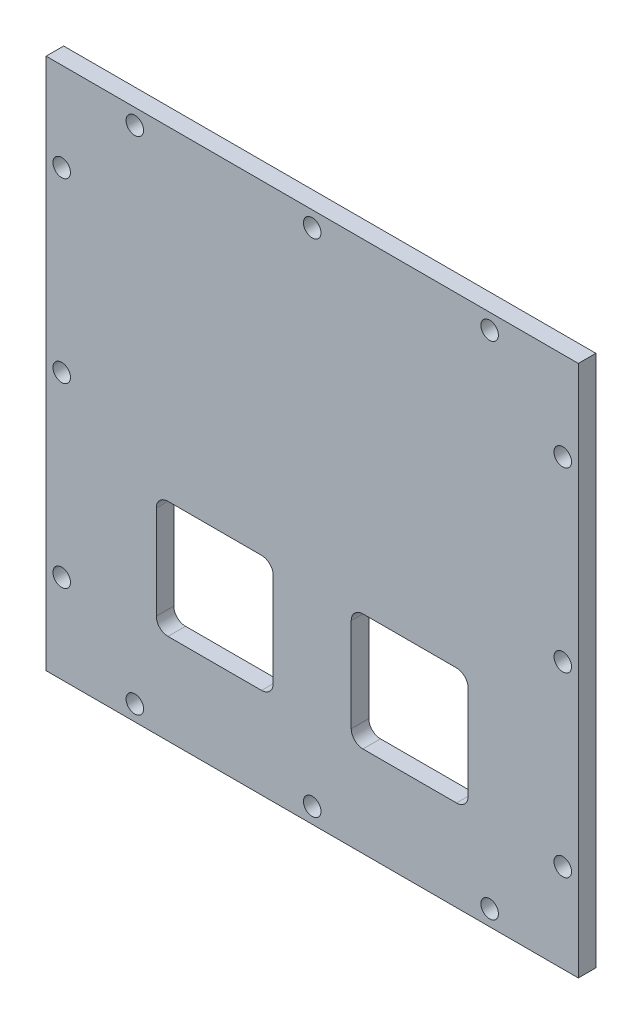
from build123d import *

# Parameters (mm, degrees)
SKETCH2_W            = 136.5
SKETCH2_H            = 136.5
BOSS_EXTRUDE1_DEPTH  = 4.5
M4_CLEARANCE_HOLE1_D = 4.5
CUT_EXTRUDE1_REACH   = 98.625


with BuildPart() as part:
    # Sketch2 → Boss-Extrude1 (new body)
    with BuildSketch(Plane.XY):
        Rectangle(SKETCH2_W, SKETCH2_H)
    extrude(amount=BOSS_EXTRUDE1_DEPTH)

    # M4 Clearance Hole1 (through all)
    with Locations(Plane.XY.offset(4.5)):
        with Locations((-64.25, 45.5), (-64.25, 0), (-64.25, -45.5), (-45.5, 64.25), (0, 64.25), (45.5, 64.25), (64.25, -45.5), (64.25, 0), (64.25, 45.5), (45.5, -64.25), (0, -64.25), (-45.5, -64.25)):
            Hole(M4_CLEARANCE_HOLE1_D / 2)

    # Sketch8 → Cut-Extrude1 (cut, up to next)
    with BuildSketch(Plane.XY.offset(4.5), mode=Mode.PRIVATE) as cut_extrude1_sk1:
        with BuildLine():
            Line((40, -18), (40, -42))
            ThreePointArc((40, -42), (39.121320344, -44.121320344), (37, -45))
            Line((37, -45), (13, -45))
            ThreePointArc((13, -45), (10.878679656, -44.121320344), (10, -42))
            Line((10, -42), (10, -18))
            ThreePointArc((10, -18), (10.878679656, -15.878679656), (13, -15))
            Line((13, -15), (37, -15))
            ThreePointArc((37, -15), (39.121320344, -15.878679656), (40, -18))
        make_face()
    cut_extrude1_tool1 = extrude(cut_extrude1_sk1.sketch, amount=-CUT_EXTRUDE1_REACH, mode=Mode.PRIVATE) & part.part
    # Sketch8 → Cut-Extrude1 (cut, up to next)
    with BuildSketch(Plane.XY.offset(4.5), mode=Mode.PRIVATE) as cut_extrude1_sk2:
        with BuildLine():
            Line((-37, -15), (-13, -15))
            ThreePointArc((-13, -15), (-10.878679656, -15.878679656), (-10, -18))
            Line((-10, -18), (-10, -42))
            ThreePointArc((-10, -42), (-10.878679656, -44.121320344), (-13, -45))
            Line((-13, -45), (-37, -45))
            ThreePointArc((-37, -45), (-39.121320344, -44.121320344), (-40, -42))
            Line((-40, -42), (-40, -18))
            ThreePointArc((-40, -18), (-39.121320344, -15.878679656), (-37, -15))
        make_face()
    cut_extrude1_tool2 = extrude(cut_extrude1_sk2.sketch, amount=-CUT_EXTRUDE1_REACH, mode=Mode.PRIVATE) & part.part
    add(cut_extrude1_tool1.solids().sort_by_distance((25, -30, 4.5))[0], mode=Mode.SUBTRACT)
    add(cut_extrude1_tool2.solids().sort_by_distance((-25, -30, 4.5))[0], mode=Mode.SUBTRACT)


solid = part.part
